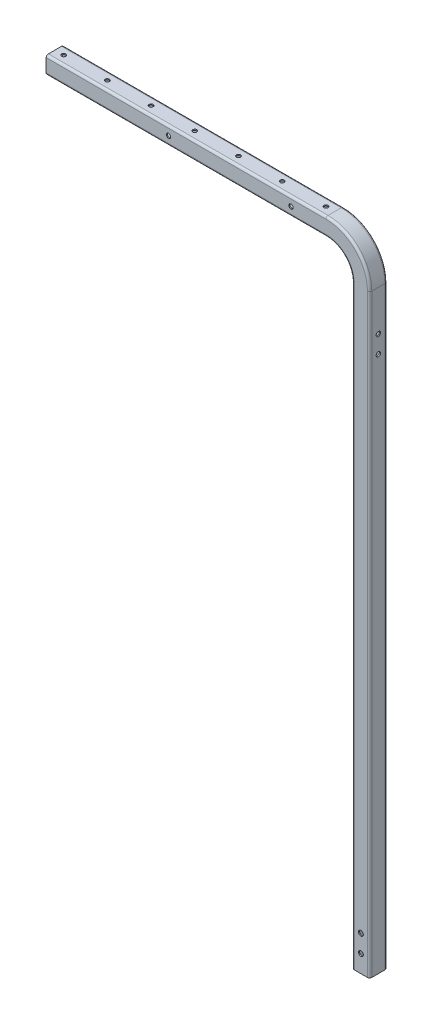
from build123d import *

# Parameters (mm, degrees)
SKETCH2_W                   = 25.4
SKETCH2_H                   = 25.4
FILLET1_R                   = 3.175
SHELL1_T                    = -1.5875
F_6_0_6_DIAMETER_HOLE1_D    = 6
LPATTERN3_COUNT             = 7
LPATTERN3_PITCH             = 63.5
SKETCH5_R                   = 3.175
CONT_MTG_DEPTH              = 1029.15108812
F_1_4_0_25_DIAMETER_HOLE1_D = 6.35
SKETCH8_R                   = 3.571875
CUT_EXTRUDE1_DEPTH          = 1029.386371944
LPATTERN2_COUNT             = 2
LPATTERN2_PITCH             = 25.4


with BuildPart() as part:
    # Base-Sweep: sweep along a path in Sketch1
    with BuildLine(Plane.XY) as base_sweep_path:
        Line((0, 0), (406.4, 0))
        ThreePointArc((406.4, 0), (442.321024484, -14.878975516), (457.2, -50.8))
        Line((457.2, -50.8), (457.2, -914.4))
    # Sketch2 (on Right Plane) → Base-Sweep (sweep)
    with BuildSketch(Plane(origin=(0, 0, 0), x_dir=(0, 0, -1), z_dir=(1, 0, 0))):
        Rectangle(SKETCH2_W, SKETCH2_H)
    sweep(path=base_sweep_path.line)

    # Fillet1
    fillet1_edges = [part.edges().sort_by_distance(p)[0] for p in [
        (451.301280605, -5.898719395, 12.7),
        (451.301280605, -5.898719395, -12.7),
        (433.340768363, -23.859231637, -12.7),
        (433.340768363, -23.859231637, 12.7),
        (469.9, -482.6, 12.7),
        (469.9, -482.6, -12.7),
        (444.5, -482.6, -12.7),
        (444.5, -482.6, 12.7),
        (203.2, 12.7, 12.7),
        (203.2, 12.7, -12.7),
        (203.2, -12.7, -12.7),
        (203.2, -12.7, 12.7),
    ]]
    fillet(fillet1_edges, radius=FILLET1_R)

    # Shell1
    shell1_openings = [part.faces().sort_by_distance(p)[0] for p in [
        (457.2, -914.4, 0),
        (0, 0, 0),
    ]]
    offset(amount=SHELL1_T, openings=shell1_openings, kind=Kind.INTERSECTION)

    # 6.0 _6_ Diameter Hole1 (through all)
    with Locations(Plane(origin=(0, 12.7, 0), x_dir=(1, 0, 0), z_dir=(0, 1, 0))):
        with Locations((393.7, 0)):
            f_6_0_6_diameter_hole1 = Hole(F_6_0_6_DIAMETER_HOLE1_D / 2)

    # LPattern3: 6.0 _6_ Diameter Hole1 ×7
    with Locations(*[(-i * LPATTERN3_PITCH, 0, 0) for i in range(1, LPATTERN3_COUNT)]):
        add(f_6_0_6_diameter_hole1, mode=Mode.SUBTRACT)

    # Sketch5 → cont_mtg (cut, through all)
    with BuildSketch(Plane(origin=(469.9, 0, 0), x_dir=(0, 0, -1), z_dir=(1, 0, 0))):
        with Locations(Location((0, -109.5375, 0), (0, 0, 90))):
            Circle(SKETCH5_R)
        with Locations(Location((0, -134.9375, 0), (0, 0, 90))):
            Circle(SKETCH5_R)
    extrude(amount=-CONT_MTG_DEPTH, mode=Mode.SUBTRACT)

    # 1_4 _0.25_ Diameter Hole1 (through all)
    with Locations(Plane.XY.offset(12.7)):
        with Locations((177.8, 0), (355.6, 0)):
            Hole(F_1_4_0_25_DIAMETER_HOLE1_D / 2)

    # Sketch8 → Cut-Extrude1 (cut, through all)
    with BuildSketch(Plane(origin=(0, 0, -12.7), x_dir=(-1, 0, 0), z_dir=(0, 0, -1))):
        with Locations(Location((-457.2, -889, 0), (0, 0, 90))):
            Circle(SKETCH8_R)
    cut_extrude1 = extrude(amount=-CUT_EXTRUDE1_DEPTH, mode=Mode.SUBTRACT)

    # LPattern2: Cut-Extrude1 ×2
    with Locations(*[(0, i * LPATTERN2_PITCH, 0) for i in range(1, LPATTERN2_COUNT)]):
        add(cut_extrude1, mode=Mode.SUBTRACT)


solid = part.part
